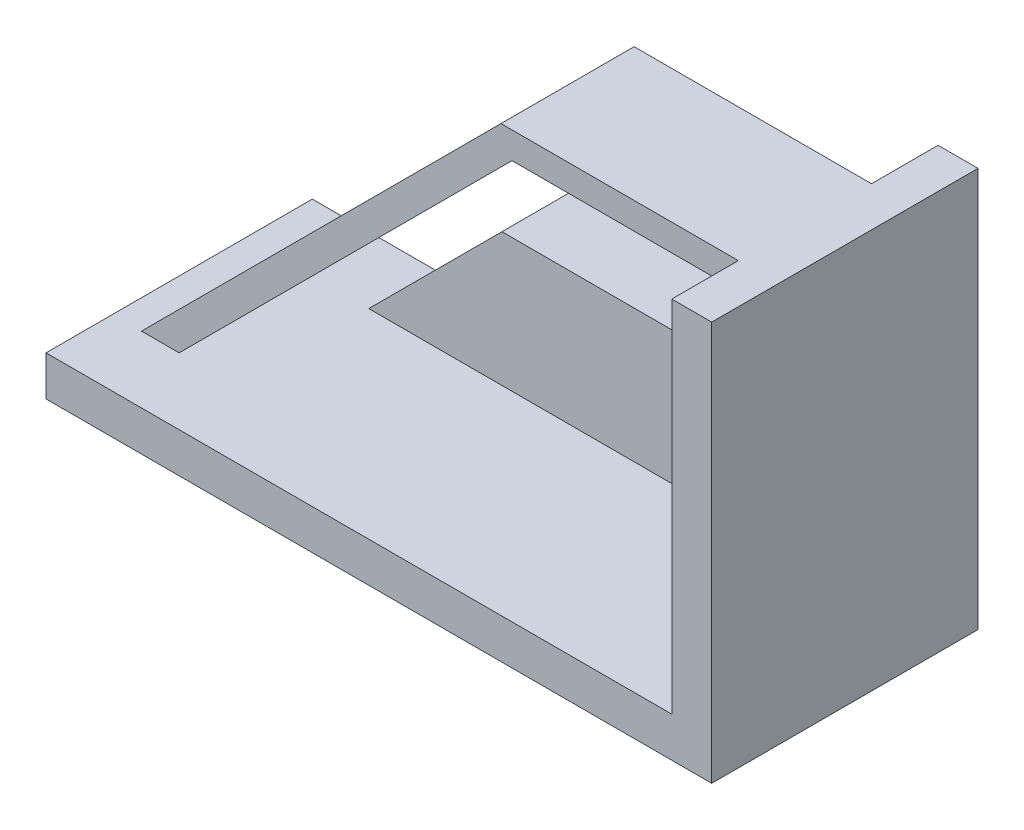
from build123d import *

# Parameters (mm, degrees)
EXTRUDE_THIN1_DEPTH = 10
EXTRUDE2_DEPTH      = 5
EXTRUDE3_REACH      = 58.648
SKETCH4_W           = 10
SKETCH4_H           = 10


with BuildPart() as part:
    # Sketch1 → Extrude-Thin1 (new, symmetric)
    with BuildSketch(Plane.XY):
        Polygon((0, 0), (50, 0), (50, 30), (47, 30), (47, 3), (0, 3), align=None)
    extrude(amount=EXTRUDE_THIN1_DEPTH, both=True)

    # Sketch2 → Extrude2 (add, symmetric)
    with BuildSketch(Plane.XY):
        Polygon((47, 28), (30, 28), (5, 3), (2.171572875, 3), (29.171572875, 30), (47, 30), align=None)
    extrude(amount=EXTRUDE2_DEPTH, both=True)

    # Extrude3: up to this plane
    extrude3_end = Plane(origin=(32.121320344, 25.878679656, 5), z_dir=(-0.7071067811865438, 0.7071067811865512, 0))
    # Sketch4 → Extrude3 (add, up to the surface)
    with BuildSketch(Plane.ZY.offset(-47), mode=Mode.PRIVATE) as extrude3_sk1:
        with Locations((0, 18)):
            Rectangle(SKETCH4_W, SKETCH4_H)
    extrude3_tool1 = split(extrude(extrude3_sk1.sketch, amount=EXTRUDE3_REACH, mode=Mode.PRIVATE), bisect_by=extrude3_end, keep=Keep.BOTH, mode=Mode.PRIVATE)
    add(extrude3_tool1.solids().sort_by_distance((47, 18, 0))[0])


solid = part.part
